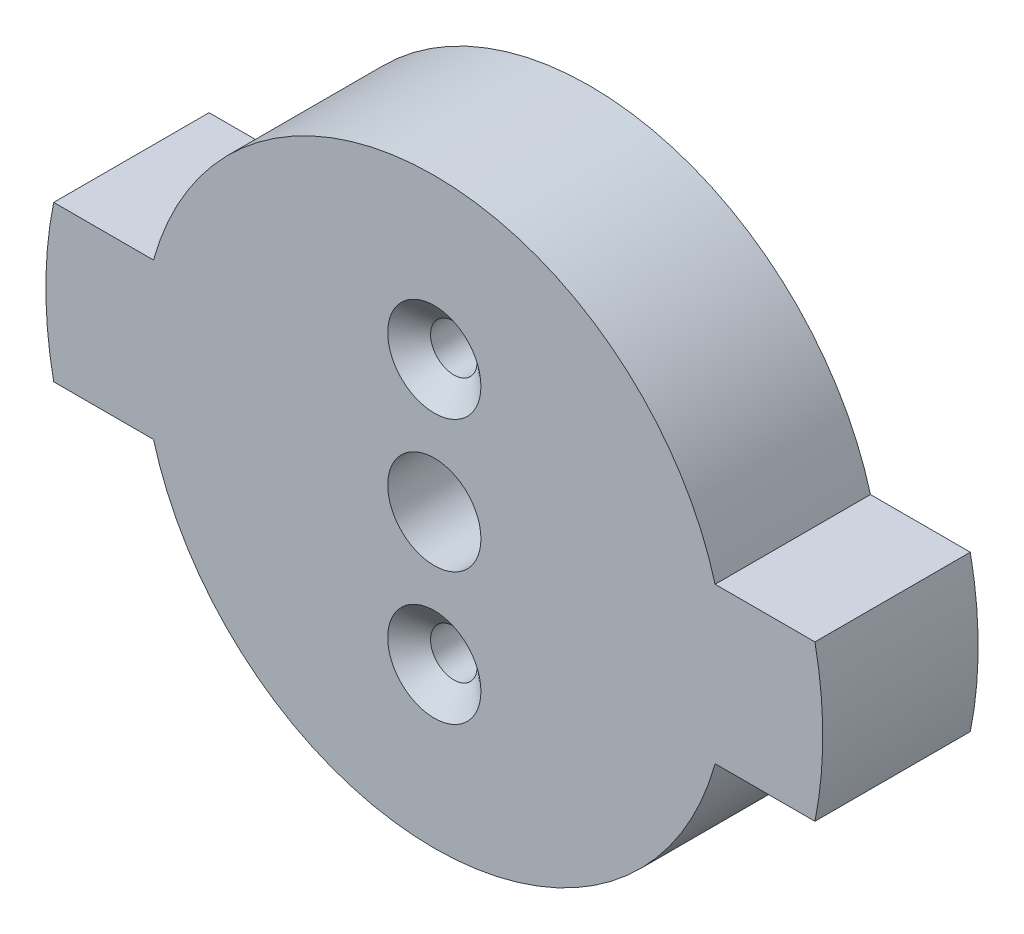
from build123d import *

# Parameters (mm, degrees)
SKETCH1_R                                           = 9.525
BOSS_EXTRUDE1_DEPTH                                 = 5.08
SKETCH2_R                                           = 1.524
SKETCH2_R_2                                         = 0.6985
CUT_EXTRUDE1_DEPTH                                  = 15.396445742
CSK_FOR_1_4_FLAT_HEAD_MACHINE_SCREW_100_D           = 1.524
CSK_FOR_1_4_FLAT_HEAD_MACHINE_SCREW_100_CSINK_D     = 3.048
CSK_FOR_1_4_FLAT_HEAD_MACHINE_SCREW_100_CSINK_ANGLE = 100
SKETCH7_R                                           = 2.54
CUT_EXTRUDE2_DEPTH                                  = 1.27
BOSS_EXTRUDE2_START                                 = -5.08
BOSS_EXTRUDE2_DEPTH                                 = 5.08


with BuildPart() as part:
    # Sketch1 → Boss-Extrude1 (new body)
    with BuildSketch(Plane.XY):
        Circle(SKETCH1_R)
    extrude(amount=BOSS_EXTRUDE1_DEPTH)

    # Sketch2 → Cut-Extrude1 (cut, through all)
    with BuildSketch(Plane.XY.offset(5.08)):
        Circle(SKETCH2_R)
        with Locations((0, 4.318)):
            Circle(SKETCH2_R_2)
        with Locations((0, -4.318)):
            Circle(SKETCH2_R_2)
    extrude(amount=-CUT_EXTRUDE1_DEPTH, mode=Mode.SUBTRACT)

    # CSK for 1_4 Flat Head Machine Screw _100 (through all)
    with Locations(Plane.XY.offset(5.08)):
        with Locations((0, -4.318), (0, 4.318)):
            CounterSinkHole(CSK_FOR_1_4_FLAT_HEAD_MACHINE_SCREW_100_D / 2, CSK_FOR_1_4_FLAT_HEAD_MACHINE_SCREW_100_CSINK_D / 2, counter_sink_angle=CSK_FOR_1_4_FLAT_HEAD_MACHINE_SCREW_100_CSINK_ANGLE)

    # Sketch7 → Cut-Extrude2 (cut)
    with BuildSketch(Plane(origin=(0, 0, 0), x_dir=(-1, 0, 0), z_dir=(0, 0, -1))):
        Circle(SKETCH7_R)
    extrude(amount=-CUT_EXTRUDE2_DEPTH, mode=Mode.SUBTRACT)

    # Sketch8 → Boss-Extrude2 (add)
    with BuildSketch(Plane.XY.offset(5.08).offset(BOSS_EXTRUDE2_START)):
        with BuildLine():
            Line((-9.180088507, 2.54), (-12.443407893, 2.54))
            ThreePointArc((-12.443407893, 2.54), (-12.7, 0), (-12.443407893, -2.54))
            Line((-12.443407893, -2.54), (-9.180088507, -2.54))
            ThreePointArc((-9.180088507, -2.54), (-9.525, 0), (-9.180088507, 2.54))
        make_face()
        with BuildLine():
            Line((9.180088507, 2.54), (12.443407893, 2.54))
            ThreePointArc((12.443407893, 2.54), (12.7, 0), (12.443407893, -2.54))
            Line((12.443407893, -2.54), (9.180088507, -2.54))
            ThreePointArc((9.180088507, -2.54), (9.525, 0), (9.180088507, 2.54))
        make_face()
    extrude(amount=BOSS_EXTRUDE2_DEPTH)


solid = part.part
